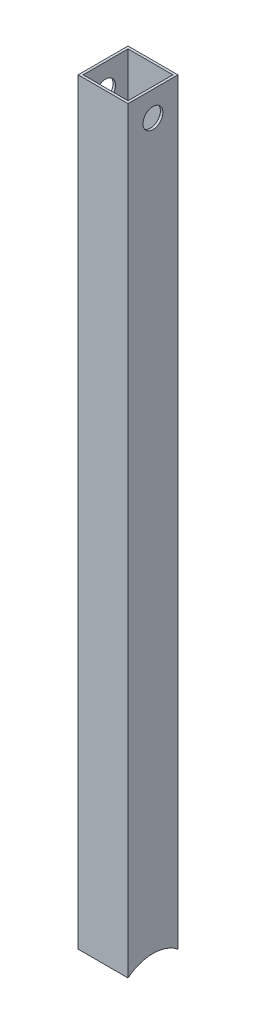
from build123d import *

# Parameters (mm, degrees)
SKETCH1_W           = 50
SKETCH1_H           = 50
BOSS_EXTRUDE1_DEPTH = 790
SHELL1_T            = -2.5
SKETCH2_R           = 10
CUT_EXTRUDE1_DEPTH  = 792.975378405
SKETCH3_R           = 40
CUT_EXTRUDE2_DEPTH  = 792.975378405


with BuildPart() as part:
    # Sketch1 → Boss-Extrude1 (new body)
    with BuildSketch(Plane(origin=(0, 0, 0), x_dir=(1, 0, 0), z_dir=(0, 1, 0))):
        Rectangle(SKETCH1_W, SKETCH1_H)
    extrude(amount=BOSS_EXTRUDE1_DEPTH)

    # Shell1
    shell1_openings = [part.faces().sort_by_distance(p)[0] for p in [
        (0, 790, 0),
        (0, 0, 0),
    ]]
    offset(amount=SHELL1_T, openings=shell1_openings, kind=Kind.INTERSECTION)

    # Sketch2 → Cut-Extrude1 (cut, through all)
    with BuildSketch(Plane(origin=(25, 0, 0), x_dir=(0, 0, -1), z_dir=(1, 0, 0))):
        with Locations((0, 764.99256211)):
            Circle(SKETCH2_R)
    extrude(amount=-CUT_EXTRUDE1_DEPTH, mode=Mode.SUBTRACT)

    # Sketch3 → Cut-Extrude2 (cut, through all)
    with BuildSketch(Plane(origin=(25, 0, 0), x_dir=(0, 0, -1), z_dir=(1, 0, 0))):
        Circle(SKETCH3_R)
    extrude(amount=-CUT_EXTRUDE2_DEPTH, mode=Mode.SUBTRACT)


solid = part.part
